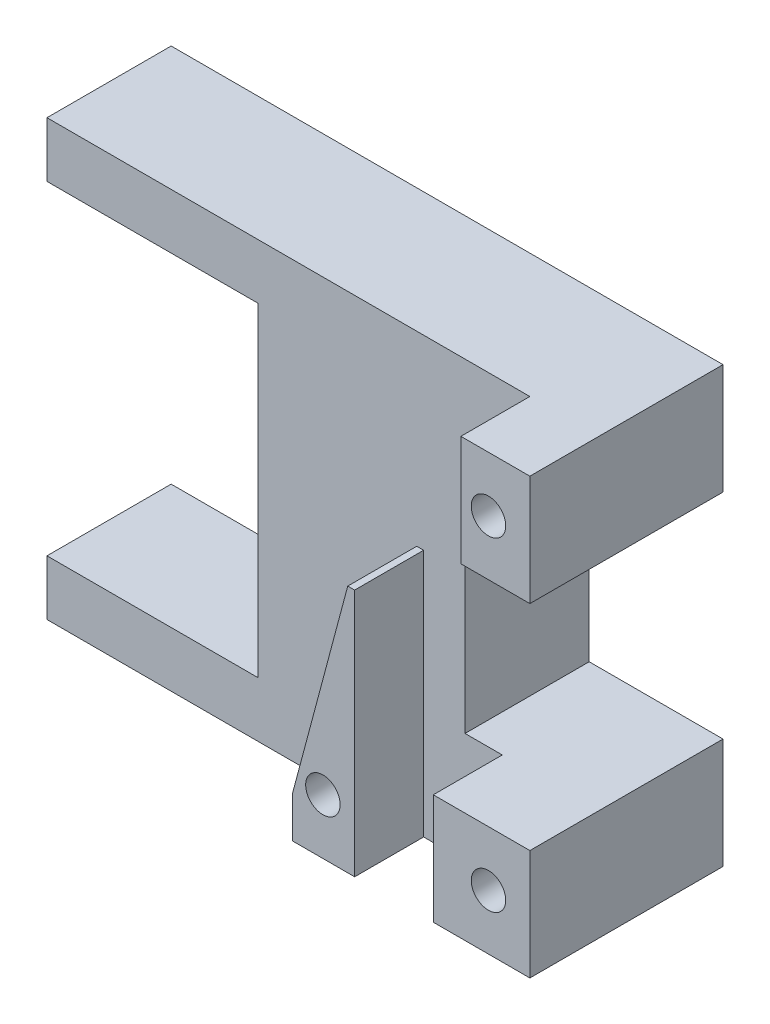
ISO-10303-21;
HEADER;
FILE_DESCRIPTION(('STEP AP214'),'2;1');
FILE_NAME('part.step','',(''),(''),'','','');
FILE_SCHEMA(('AUTOMOTIVE_DESIGN { 1 0 10303 214 1 1 1 1 }'));
ENDSEC;
DATA;
#1=APPLICATION_CONTEXT('core data for automotive mechanical design processes');
#2=APPLICATION_PROTOCOL_DEFINITION('international standard','automotive_design',2000,#1);
#3=PRODUCT_CONTEXT('',#1,'mechanical');
#4=PRODUCT('Part','Part','',(#3));
#5=PRODUCT_RELATED_PRODUCT_CATEGORY('part','',(#4));
#6=PRODUCT_DEFINITION_FORMATION('','',#4);
#7=PRODUCT_DEFINITION_CONTEXT('part definition',#1,'design');
#8=PRODUCT_DEFINITION('design','',#6,#7);
#9=PRODUCT_DEFINITION_SHAPE('','',#8);
#10=(LENGTH_UNIT() NAMED_UNIT(*) SI_UNIT(.MILLI.,.METRE.));
#11=(NAMED_UNIT(*) PLANE_ANGLE_UNIT() SI_UNIT($,.RADIAN.));
#12=(NAMED_UNIT(*) SI_UNIT($,.STERADIAN.) SOLID_ANGLE_UNIT());
#13=UNCERTAINTY_MEASURE_WITH_UNIT(LENGTH_MEASURE(1.E-05),#10,'distance_accuracy_value','');
#14=(GEOMETRIC_REPRESENTATION_CONTEXT(3) GLOBAL_UNCERTAINTY_ASSIGNED_CONTEXT((#13)) GLOBAL_UNIT_ASSIGNED_CONTEXT((#10,
#11,#12)) REPRESENTATION_CONTEXT('',''));
#15=CARTESIAN_POINT('',(0.,0.,0.));
#16=DIRECTION('',(0.,0.,1.));
#17=DIRECTION('',(1.,0.,0.));
#18=AXIS2_PLACEMENT_3D('',#15,#16,#17);
#19=CARTESIAN_POINT('',(0.,0.,9.));
#20=DIRECTION('',(0.,0.,1.));
#21=DIRECTION('',(1.,0.,0.));
#22=AXIS2_PLACEMENT_3D('',#19,#20,#21);
#23=PLANE('',#22);
#24=DIRECTION('',(-1.,0.,0.));
#25=VECTOR('',#24,1.);
#26=CARTESIAN_POINT('',(0.,-3.29328784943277,9.));
#27=LINE('',#26,#25);
#28=CARTESIAN_POINT('',(32.4932731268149,-3.29328784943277,9.));
#29=VERTEX_POINT('',#28);
#30=CARTESIAN_POINT('',(27.7932731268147,-3.29328784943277,9.));
#31=VERTEX_POINT('',#30);
#32=EDGE_CURVE('E225',#29,#31,#27,.T.);
#33=ORIENTED_EDGE('',*,*,#32,.F.);
#34=DIRECTION('',(0.,-1.,0.));
#35=VECTOR('',#34,1.);
#36=CARTESIAN_POINT('',(32.4932731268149,0.,9.));
#37=LINE('',#36,#35);
#38=CARTESIAN_POINT('',(32.4932731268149,4.70671215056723,9.));
#39=VERTEX_POINT('',#38);
#40=EDGE_CURVE('E209',#39,#29,#37,.T.);
#41=ORIENTED_EDGE('',*,*,#40,.F.);
#42=DIRECTION('',(1.,0.,0.));
#43=VECTOR('',#42,1.);
#44=CARTESIAN_POINT('',(0.,4.70671215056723,9.));
#45=LINE('',#44,#43);
#46=CARTESIAN_POINT('',(-2.5067268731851,4.70671215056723,9.));
#47=VERTEX_POINT('',#46);
#48=EDGE_CURVE('E234',#47,#39,#45,.T.);
#49=ORIENTED_EDGE('',*,*,#48,.F.);
#50=DIRECTION('',(0.,-1.,0.));
#51=VECTOR('',#50,1.);
#52=CARTESIAN_POINT('',(-2.5067268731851,0.,9.));
#53=LINE('',#52,#51);
#54=CARTESIAN_POINT('',(-2.5067268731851,0.706712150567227,9.));
#55=VERTEX_POINT('',#54);
#56=EDGE_CURVE('E236',#47,#55,#53,.T.);
#57=ORIENTED_EDGE('',*,*,#56,.T.);
#58=DIRECTION('',(1.,0.,0.));
#59=VECTOR('',#58,1.);
#60=CARTESIAN_POINT('',(0.,0.706712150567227,9.));
#61=LINE('',#60,#59);
#62=CARTESIAN_POINT('',(12.7932731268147,0.706712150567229,9.));
#63=VERTEX_POINT('',#62);
#64=EDGE_CURVE('E243',#55,#63,#61,.T.);
#65=ORIENTED_EDGE('',*,*,#64,.T.);
#66=DIRECTION('',(0.,1.,0.));
#67=VECTOR('',#66,1.);
#68=CARTESIAN_POINT('',(12.7932731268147,0.,9.));
#69=LINE('',#68,#67);
#70=CARTESIAN_POINT('',(12.7932731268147,-22.7932878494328,9.));
#71=VERTEX_POINT('',#70);
#72=EDGE_CURVE('E245',#71,#63,#69,.T.);
#73=ORIENTED_EDGE('',*,*,#72,.F.);
#74=DIRECTION('',(1.,0.,0.));
#75=VECTOR('',#74,1.);
#76=CARTESIAN_POINT('',(0.,-22.7932878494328,9.));
#77=LINE('',#76,#75);
#78=CARTESIAN_POINT('',(-2.5067268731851,-22.7932878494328,9.));
#79=VERTEX_POINT('',#78);
#80=EDGE_CURVE('E248',#79,#71,#77,.T.);
#81=ORIENTED_EDGE('',*,*,#80,.F.);
#82=DIRECTION('',(0.,1.,0.));
#83=VECTOR('',#82,1.);
#84=CARTESIAN_POINT('',(-2.5067268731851,0.,9.));
#85=LINE('',#84,#83);
#86=CARTESIAN_POINT('',(-2.5067268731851,-26.7932878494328,9.));
#87=VERTEX_POINT('',#86);
#88=EDGE_CURVE('E251',#87,#79,#85,.T.);
#89=ORIENTED_EDGE('',*,*,#88,.F.);
#90=DIRECTION('',(1.,0.,0.));
#91=VECTOR('',#90,1.);
#92=CARTESIAN_POINT('',(0.,-26.7932878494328,9.));
#93=LINE('',#92,#91);
#94=CARTESIAN_POINT('',(20.2932731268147,-26.7932878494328,9.));
#95=VERTEX_POINT('',#94);
#96=EDGE_CURVE('E426',#87,#95,#93,.T.);
#97=ORIENTED_EDGE('',*,*,#96,.T.);
#98=DIRECTION('',(0.,1.,0.));
#99=VECTOR('',#98,1.);
#100=CARTESIAN_POINT('',(20.2932731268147,0.,9.));
#101=LINE('',#100,#99);
#102=CARTESIAN_POINT('',(20.2932731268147,-23.793287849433,9.));
#103=VERTEX_POINT('',#102);
#104=EDGE_CURVE('E445',#95,#103,#101,.T.);
#105=ORIENTED_EDGE('',*,*,#104,.T.);
#106=DIRECTION('',(0.257662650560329,0.966234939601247,0.));
#107=VECTOR('',#106,1.);
#108=CARTESIAN_POINT('',(20.2932731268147,-23.793287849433,9.));
#109=LINE('',#108,#107);
#110=CARTESIAN_POINT('',(24.2932731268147,-8.79328784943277,9.));
#111=VERTEX_POINT('',#110);
#112=EDGE_CURVE('E12',#103,#111,#109,.T.);
#113=ORIENTED_EDGE('',*,*,#112,.T.);
#114=DIRECTION('',(-1.,0.,0.));
#115=VECTOR('',#114,1.);
#116=CARTESIAN_POINT('',(0.,-8.79328784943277,9.));
#117=LINE('',#116,#115);
#118=CARTESIAN_POINT('',(24.7932731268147,-8.79328784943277,9.));
#119=VERTEX_POINT('',#118);
#120=EDGE_CURVE('E451',#119,#111,#117,.T.);
#121=ORIENTED_EDGE('',*,*,#120,.F.);
#122=DIRECTION('',(0.,1.,0.));
#123=VECTOR('',#122,1.);
#124=CARTESIAN_POINT('',(24.7932731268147,0.,9.));
#125=LINE('',#124,#123);
#126=CARTESIAN_POINT('',(24.7932731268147,-26.7932878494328,9.));
#127=VERTEX_POINT('',#126);
#128=EDGE_CURVE('E435',#127,#119,#125,.T.);
#129=ORIENTED_EDGE('',*,*,#128,.F.);
#130=CARTESIAN_POINT('',(30.4932731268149,-26.7932878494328,9.));
#131=VERTEX_POINT('',#130);
#132=EDGE_CURVE('E289',#127,#131,#93,.T.);
#133=ORIENTED_EDGE('',*,*,#132,.T.);
#134=DIRECTION('',(0.,1.,0.));
#135=VECTOR('',#134,1.);
#136=CARTESIAN_POINT('',(30.4932731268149,0.,9.));
#137=LINE('',#136,#135);
#138=CARTESIAN_POINT('',(30.4932731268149,-18.7932878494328,9.));
#139=VERTEX_POINT('',#138);
#140=EDGE_CURVE('E432',#131,#139,#137,.T.);
#141=ORIENTED_EDGE('',*,*,#140,.T.);
#142=DIRECTION('',(-1.,0.,0.));
#143=VECTOR('',#142,1.);
#144=CARTESIAN_POINT('',(0.,-18.7932878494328,9.));
#145=LINE('',#144,#143);
#146=CARTESIAN_POINT('',(27.7932731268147,-18.7932878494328,9.));
#147=VERTEX_POINT('',#146);
#148=EDGE_CURVE('E238',#139,#147,#145,.T.);
#149=ORIENTED_EDGE('',*,*,#148,.T.);
#150=DIRECTION('',(0.,1.,0.));
#151=VECTOR('',#150,1.);
#152=CARTESIAN_POINT('',(27.7932731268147,0.,9.));
#153=LINE('',#152,#151);
#154=EDGE_CURVE('E232',#147,#31,#153,.T.);
#155=ORIENTED_EDGE('',*,*,#154,.T.);
#156=EDGE_LOOP('',(#33,#41,#49,#57,#65,#73,#81,#89,#97,#105,#113,#121,#129,#133,#141,#149,#155));
#157=FACE_BOUND('',#156,.T.);
#158=ADVANCED_FACE('F67',(#157),#23,.T.);
#159=CARTESIAN_POINT('',(0.,-26.7932878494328,9.));
#160=DIRECTION('',(0.,1.,0.));
#161=DIRECTION('',(0.,0.,1.));
#162=AXIS2_PLACEMENT_3D('',#159,#160,#161);
#163=PLANE('',#162);
#164=DIRECTION('',(1.,0.,0.));
#165=VECTOR('',#164,1.);
#166=CARTESIAN_POINT('',(0.,-26.7932878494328,0.));
#167=LINE('',#166,#165);
#168=CARTESIAN_POINT('',(-2.5067268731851,-26.7932878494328,0.));
#169=VERTEX_POINT('',#168);
#170=CARTESIAN_POINT('',(37.4932731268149,-26.7932878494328,0.));
#171=VERTEX_POINT('',#170);
#172=EDGE_CURVE('E255',#169,#171,#167,.T.);
#173=ORIENTED_EDGE('',*,*,#172,.T.);
#174=DIRECTION('',(0.,0.,-1.));
#175=VECTOR('',#174,1.);
#176=CARTESIAN_POINT('',(37.4932731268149,-26.7932878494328,9.));
#177=LINE('',#176,#175);
#178=CARTESIAN_POINT('',(37.4932731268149,-26.7932878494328,14.));
#179=VERTEX_POINT('',#178);
#180=EDGE_CURVE('E314',#179,#171,#177,.T.);
#181=ORIENTED_EDGE('',*,*,#180,.F.);
#182=DIRECTION('',(1.,0.,0.));
#183=VECTOR('',#182,1.);
#184=CARTESIAN_POINT('',(0.,-26.7932878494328,14.));
#185=LINE('',#184,#183);
#186=CARTESIAN_POINT('',(30.4932731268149,-26.7932878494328,14.));
#187=VERTEX_POINT('',#186);
#188=EDGE_CURVE('E439',#187,#179,#185,.T.);
#189=ORIENTED_EDGE('',*,*,#188,.F.);
#190=DIRECTION('',(0.,0.,-1.));
#191=VECTOR('',#190,1.);
#192=CARTESIAN_POINT('',(30.4932731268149,-26.7932878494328,14.));
#193=LINE('',#192,#191);
#194=EDGE_CURVE('E259',#187,#131,#193,.T.);
#195=ORIENTED_EDGE('',*,*,#194,.T.);
#196=ORIENTED_EDGE('',*,*,#132,.F.);
#197=DIRECTION('',(0.,0.,-1.));
#198=VECTOR('',#197,1.);
#199=CARTESIAN_POINT('',(24.7932731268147,-26.7932878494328,14.));
#200=LINE('',#199,#198);
#201=CARTESIAN_POINT('',(24.7932731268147,-26.7932878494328,14.));
#202=VERTEX_POINT('',#201);
#203=EDGE_CURVE('E448',#202,#127,#200,.T.);
#204=ORIENTED_EDGE('',*,*,#203,.F.);
#205=DIRECTION('',(1.,0.,0.));
#206=VECTOR('',#205,1.);
#207=CARTESIAN_POINT('',(0.,-26.7932878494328,14.));
#208=LINE('',#207,#206);
#209=CARTESIAN_POINT('',(20.2932731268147,-26.7932878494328,14.));
#210=VERTEX_POINT('',#209);
#211=EDGE_CURVE('E336',#210,#202,#208,.T.);
#212=ORIENTED_EDGE('',*,*,#211,.F.);
#213=DIRECTION('',(0.,0.,-1.));
#214=VECTOR('',#213,1.);
#215=CARTESIAN_POINT('',(20.2932731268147,-26.7932878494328,14.));
#216=LINE('',#215,#214);
#217=EDGE_CURVE('E334',#210,#95,#216,.T.);
#218=ORIENTED_EDGE('',*,*,#217,.T.);
#219=ORIENTED_EDGE('',*,*,#96,.F.);
#220=DIRECTION('',(0.,0.,-1.));
#221=VECTOR('',#220,1.);
#222=CARTESIAN_POINT('',(-2.5067268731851,-26.7932878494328,9.));
#223=LINE('',#222,#221);
#224=EDGE_CURVE('E254',#87,#169,#223,.T.);
#225=ORIENTED_EDGE('',*,*,#224,.T.);
#226=EDGE_LOOP('',(#173,#181,#189,#195,#196,#204,#212,#218,#219,#225));
#227=FACE_BOUND('',#226,.T.);
#228=ADVANCED_FACE('F353',(#227),#163,.F.);
#229=CARTESIAN_POINT('',(37.4932731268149,0.,9.));
#230=DIRECTION('',(-1.,0.,0.));
#231=DIRECTION('',(0.,0.,1.));
#232=AXIS2_PLACEMENT_3D('',#229,#230,#231);
#233=PLANE('',#232);
#234=DIRECTION('',(0.,1.,0.));
#235=VECTOR('',#234,1.);
#236=CARTESIAN_POINT('',(37.4932731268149,0.,0.));
#237=LINE('',#236,#235);
#238=CARTESIAN_POINT('',(37.4932731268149,-18.7932878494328,0.));
#239=VERTEX_POINT('',#238);
#240=EDGE_CURVE('E258',#171,#239,#237,.T.);
#241=ORIENTED_EDGE('',*,*,#240,.T.);
#242=DIRECTION('',(0.,0.,-1.));
#243=VECTOR('',#242,1.);
#244=CARTESIAN_POINT('',(37.4932731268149,-18.7932878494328,9.));
#245=LINE('',#244,#243);
#246=CARTESIAN_POINT('',(37.4932731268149,-18.7932878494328,14.));
#247=VERTEX_POINT('',#246);
#248=EDGE_CURVE('E311',#247,#239,#245,.T.);
#249=ORIENTED_EDGE('',*,*,#248,.F.);
#250=DIRECTION('',(0.,1.,0.));
#251=VECTOR('',#250,1.);
#252=CARTESIAN_POINT('',(37.4932731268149,0.,14.));
#253=LINE('',#252,#251);
#254=EDGE_CURVE('E437',#179,#247,#253,.T.);
#255=ORIENTED_EDGE('',*,*,#254,.F.);
#256=ORIENTED_EDGE('',*,*,#180,.T.);
#257=EDGE_LOOP('',(#241,#249,#255,#256));
#258=FACE_BOUND('',#257,.T.);
#259=ADVANCED_FACE('F360',(#258),#233,.F.);
#260=CARTESIAN_POINT('',(0.,-18.7932878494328,9.));
#261=DIRECTION('',(0.,-1.,0.));
#262=DIRECTION('',(0.,0.,-1.));
#263=AXIS2_PLACEMENT_3D('',#260,#261,#262);
#264=PLANE('',#263);
#265=DIRECTION('',(-1.,0.,0.));
#266=VECTOR('',#265,1.);
#267=CARTESIAN_POINT('',(0.,-18.7932878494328,0.));
#268=LINE('',#267,#266);
#269=CARTESIAN_POINT('',(27.7932731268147,-18.7932878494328,0.));
#270=VERTEX_POINT('',#269);
#271=EDGE_CURVE('E261',#239,#270,#268,.T.);
#272=ORIENTED_EDGE('',*,*,#271,.T.);
#273=DIRECTION('',(0.,0.,-1.));
#274=VECTOR('',#273,1.);
#275=CARTESIAN_POINT('',(27.7932731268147,-18.7932878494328,9.));
#276=LINE('',#275,#274);
#277=EDGE_CURVE('E308',#147,#270,#276,.T.);
#278=ORIENTED_EDGE('',*,*,#277,.F.);
#279=ORIENTED_EDGE('',*,*,#148,.F.);
#280=DIRECTION('',(0.,0.,-1.));
#281=VECTOR('',#280,1.);
#282=CARTESIAN_POINT('',(30.4932731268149,-18.7932878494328,14.));
#283=LINE('',#282,#281);
#284=CARTESIAN_POINT('',(30.4932731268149,-18.7932878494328,14.));
#285=VERTEX_POINT('',#284);
#286=EDGE_CURVE('E423',#285,#139,#283,.T.);
#287=ORIENTED_EDGE('',*,*,#286,.F.);
#288=DIRECTION('',(-1.,0.,0.));
#289=VECTOR('',#288,1.);
#290=CARTESIAN_POINT('',(0.,-18.7932878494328,14.));
#291=LINE('',#290,#289);
#292=EDGE_CURVE('E420',#247,#285,#291,.T.);
#293=ORIENTED_EDGE('',*,*,#292,.F.);
#294=ORIENTED_EDGE('',*,*,#248,.T.);
#295=EDGE_LOOP('',(#272,#278,#279,#287,#293,#294));
#296=FACE_BOUND('',#295,.T.);
#297=ADVANCED_FACE('F403',(#296),#264,.F.);
#298=CARTESIAN_POINT('',(27.7932731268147,0.,9.));
#299=DIRECTION('',(-1.,0.,0.));
#300=DIRECTION('',(0.,-1.,0.));
#301=AXIS2_PLACEMENT_3D('',#298,#299,#300);
#302=PLANE('',#301);
#303=DIRECTION('',(0.,1.,0.));
#304=VECTOR('',#303,1.);
#305=CARTESIAN_POINT('',(27.7932731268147,0.,0.));
#306=LINE('',#305,#304);
#307=CARTESIAN_POINT('',(27.7932731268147,-3.29328784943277,0.));
#308=VERTEX_POINT('',#307);
#309=EDGE_CURVE('E263',#270,#308,#306,.T.);
#310=ORIENTED_EDGE('',*,*,#309,.T.);
#311=DIRECTION('',(0.,0.,-1.));
#312=VECTOR('',#311,1.);
#313=CARTESIAN_POINT('',(27.7932731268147,-3.29328784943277,9.));
#314=LINE('',#313,#312);
#315=EDGE_CURVE('E306',#31,#308,#314,.T.);
#316=ORIENTED_EDGE('',*,*,#315,.F.);
#317=ORIENTED_EDGE('',*,*,#154,.F.);
#318=ORIENTED_EDGE('',*,*,#277,.T.);
#319=EDGE_LOOP('',(#310,#316,#317,#318));
#320=FACE_BOUND('',#319,.T.);
#321=ADVANCED_FACE('F400',(#320),#302,.F.);
#322=CARTESIAN_POINT('',(0.,-3.29328784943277,9.));
#323=DIRECTION('',(0.,-1.,0.));
#324=DIRECTION('',(0.,0.,-1.));
#325=AXIS2_PLACEMENT_3D('',#322,#323,#324);
#326=PLANE('',#325);
#327=DIRECTION('',(-1.,0.,0.));
#328=VECTOR('',#327,1.);
#329=CARTESIAN_POINT('',(0.,-3.29328784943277,0.));
#330=LINE('',#329,#328);
#331=CARTESIAN_POINT('',(37.4932731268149,-3.29328784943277,0.));
#332=VERTEX_POINT('',#331);
#333=EDGE_CURVE('E266',#332,#308,#330,.T.);
#334=ORIENTED_EDGE('',*,*,#333,.F.);
#335=DIRECTION('',(0.,0.,-1.));
#336=VECTOR('',#335,1.);
#337=CARTESIAN_POINT('',(37.4932731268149,-3.29328784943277,9.));
#338=LINE('',#337,#336);
#339=CARTESIAN_POINT('',(37.4932731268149,-3.29328784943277,14.));
#340=VERTEX_POINT('',#339);
#341=EDGE_CURVE('E304',#340,#332,#338,.T.);
#342=ORIENTED_EDGE('',*,*,#341,.F.);
#343=DIRECTION('',(1.,0.,0.));
#344=VECTOR('',#343,1.);
#345=CARTESIAN_POINT('',(0.,-3.29328784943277,14.));
#346=LINE('',#345,#344);
#347=CARTESIAN_POINT('',(32.4932731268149,-3.29328784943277,14.));
#348=VERTEX_POINT('',#347);
#349=EDGE_CURVE('E228',#348,#340,#346,.T.);
#350=ORIENTED_EDGE('',*,*,#349,.F.);
#351=DIRECTION('',(0.,0.,-1.));
#352=VECTOR('',#351,1.);
#353=CARTESIAN_POINT('',(32.4932731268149,-3.29328784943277,14.));
#354=LINE('',#353,#352);
#355=EDGE_CURVE('E212',#348,#29,#354,.T.);
#356=ORIENTED_EDGE('',*,*,#355,.T.);
#357=ORIENTED_EDGE('',*,*,#32,.T.);
#358=ORIENTED_EDGE('',*,*,#315,.T.);
#359=EDGE_LOOP('',(#334,#342,#350,#356,#357,#358));
#360=FACE_BOUND('',#359,.T.);
#361=ADVANCED_FACE('F224',(#360),#326,.T.);
#362=CARTESIAN_POINT('',(37.4932731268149,0.,9.));
#363=DIRECTION('',(1.,0.,0.));
#364=DIRECTION('',(0.,0.,-1.));
#365=AXIS2_PLACEMENT_3D('',#362,#363,#364);
#366=PLANE('',#365);
#367=DIRECTION('',(0.,-1.,0.));
#368=VECTOR('',#367,1.);
#369=CARTESIAN_POINT('',(37.4932731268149,0.,0.));
#370=LINE('',#369,#368);
#371=CARTESIAN_POINT('',(37.4932731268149,4.70671215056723,0.));
#372=VERTEX_POINT('',#371);
#373=EDGE_CURVE('E269',#372,#332,#370,.T.);
#374=ORIENTED_EDGE('',*,*,#373,.F.);
#375=DIRECTION('',(0.,0.,-1.));
#376=VECTOR('',#375,1.);
#377=CARTESIAN_POINT('',(37.4932731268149,4.70671215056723,9.));
#378=LINE('',#377,#376);
#379=CARTESIAN_POINT('',(37.4932731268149,4.70671215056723,14.));
#380=VERTEX_POINT('',#379);
#381=EDGE_CURVE('E302',#380,#372,#378,.T.);
#382=ORIENTED_EDGE('',*,*,#381,.F.);
#383=DIRECTION('',(0.,1.,0.));
#384=VECTOR('',#383,1.);
#385=CARTESIAN_POINT('',(37.4932731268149,0.,14.));
#386=LINE('',#385,#384);
#387=EDGE_CURVE('E229',#340,#380,#386,.T.);
#388=ORIENTED_EDGE('',*,*,#387,.F.);
#389=ORIENTED_EDGE('',*,*,#341,.T.);
#390=EDGE_LOOP('',(#374,#382,#388,#389));
#391=FACE_BOUND('',#390,.T.);
#392=ADVANCED_FACE('F393',(#391),#366,.T.);
#393=CARTESIAN_POINT('',(0.,4.70671215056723,9.));
#394=DIRECTION('',(0.,1.,0.));
#395=DIRECTION('',(-1.,0.,0.));
#396=AXIS2_PLACEMENT_3D('',#393,#394,#395);
#397=PLANE('',#396);
#398=DIRECTION('',(1.,0.,0.));
#399=VECTOR('',#398,1.);
#400=CARTESIAN_POINT('',(0.,4.70671215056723,0.));
#401=LINE('',#400,#399);
#402=CARTESIAN_POINT('',(-2.5067268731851,4.70671215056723,0.));
#403=VERTEX_POINT('',#402);
#404=EDGE_CURVE('E272',#403,#372,#401,.T.);
#405=ORIENTED_EDGE('',*,*,#404,.F.);
#406=DIRECTION('',(0.,0.,-1.));
#407=VECTOR('',#406,1.);
#408=CARTESIAN_POINT('',(-2.5067268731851,4.70671215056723,9.));
#409=LINE('',#408,#407);
#410=EDGE_CURVE('E300',#47,#403,#409,.T.);
#411=ORIENTED_EDGE('',*,*,#410,.F.);
#412=ORIENTED_EDGE('',*,*,#48,.T.);
#413=DIRECTION('',(0.,0.,-1.));
#414=VECTOR('',#413,1.);
#415=CARTESIAN_POINT('',(32.4932731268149,4.70671215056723,14.));
#416=LINE('',#415,#414);
#417=CARTESIAN_POINT('',(32.4932731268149,4.70671215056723,14.));
#418=VERTEX_POINT('',#417);
#419=EDGE_CURVE('E215',#418,#39,#416,.T.);
#420=ORIENTED_EDGE('',*,*,#419,.F.);
#421=DIRECTION('',(-1.,0.,0.));
#422=VECTOR('',#421,1.);
#423=CARTESIAN_POINT('',(0.,4.70671215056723,14.));
#424=LINE('',#423,#422);
#425=EDGE_CURVE('E220',#380,#418,#424,.T.);
#426=ORIENTED_EDGE('',*,*,#425,.F.);
#427=ORIENTED_EDGE('',*,*,#381,.T.);
#428=EDGE_LOOP('',(#405,#411,#412,#420,#426,#427));
#429=FACE_BOUND('',#428,.T.);
#430=ADVANCED_FACE('F389',(#429),#397,.T.);
#431=CARTESIAN_POINT('',(-2.5067268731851,0.,9.));
#432=DIRECTION('',(1.,0.,0.));
#433=DIRECTION('',(0.,0.,-1.));
#434=AXIS2_PLACEMENT_3D('',#431,#432,#433);
#435=PLANE('',#434);
#436=DIRECTION('',(0.,-1.,0.));
#437=VECTOR('',#436,1.);
#438=CARTESIAN_POINT('',(-2.5067268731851,0.,0.));
#439=LINE('',#438,#437);
#440=CARTESIAN_POINT('',(-2.5067268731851,0.706712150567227,0.));
#441=VERTEX_POINT('',#440);
#442=EDGE_CURVE('E275',#403,#441,#439,.T.);
#443=ORIENTED_EDGE('',*,*,#442,.T.);
#444=DIRECTION('',(0.,0.,-1.));
#445=VECTOR('',#444,1.);
#446=CARTESIAN_POINT('',(-2.5067268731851,0.706712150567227,9.));
#447=LINE('',#446,#445);
#448=EDGE_CURVE('E297',#55,#441,#447,.T.);
#449=ORIENTED_EDGE('',*,*,#448,.F.);
#450=ORIENTED_EDGE('',*,*,#56,.F.);
#451=ORIENTED_EDGE('',*,*,#410,.T.);
#452=EDGE_LOOP('',(#443,#449,#450,#451));
#453=FACE_BOUND('',#452,.T.);
#454=ADVANCED_FACE('F385',(#453),#435,.F.);
#455=CARTESIAN_POINT('',(0.,0.706712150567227,9.));
#456=DIRECTION('',(0.,1.,0.));
#457=DIRECTION('',(-1.,0.,0.));
#458=AXIS2_PLACEMENT_3D('',#455,#456,#457);
#459=PLANE('',#458);
#460=DIRECTION('',(1.,0.,0.));
#461=VECTOR('',#460,1.);
#462=CARTESIAN_POINT('',(0.,0.706712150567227,0.));
#463=LINE('',#462,#461);
#464=CARTESIAN_POINT('',(12.7932731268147,0.706712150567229,0.));
#465=VERTEX_POINT('',#464);
#466=EDGE_CURVE('E277',#441,#465,#463,.T.);
#467=ORIENTED_EDGE('',*,*,#466,.T.);
#468=DIRECTION('',(0.,0.,-1.));
#469=VECTOR('',#468,1.);
#470=CARTESIAN_POINT('',(12.7932731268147,0.706712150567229,9.));
#471=LINE('',#470,#469);
#472=EDGE_CURVE('E295',#63,#465,#471,.T.);
#473=ORIENTED_EDGE('',*,*,#472,.F.);
#474=ORIENTED_EDGE('',*,*,#64,.F.);
#475=ORIENTED_EDGE('',*,*,#448,.T.);
#476=EDGE_LOOP('',(#467,#473,#474,#475));
#477=FACE_BOUND('',#476,.T.);
#478=ADVANCED_FACE('F381',(#477),#459,.F.);
#479=CARTESIAN_POINT('',(12.7932731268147,0.,9.));
#480=DIRECTION('',(-1.,0.,0.));
#481=DIRECTION('',(0.,-1.,0.));
#482=AXIS2_PLACEMENT_3D('',#479,#480,#481);
#483=PLANE('',#482);
#484=DIRECTION('',(0.,1.,0.));
#485=VECTOR('',#484,1.);
#486=CARTESIAN_POINT('',(12.7932731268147,0.,0.));
#487=LINE('',#486,#485);
#488=CARTESIAN_POINT('',(12.7932731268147,-22.7932878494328,0.));
#489=VERTEX_POINT('',#488);
#490=EDGE_CURVE('E280',#489,#465,#487,.T.);
#491=ORIENTED_EDGE('',*,*,#490,.F.);
#492=DIRECTION('',(0.,0.,-1.));
#493=VECTOR('',#492,1.);
#494=CARTESIAN_POINT('',(12.7932731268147,-22.7932878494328,9.));
#495=LINE('',#494,#493);
#496=EDGE_CURVE('E293',#71,#489,#495,.T.);
#497=ORIENTED_EDGE('',*,*,#496,.F.);
#498=ORIENTED_EDGE('',*,*,#72,.T.);
#499=ORIENTED_EDGE('',*,*,#472,.T.);
#500=EDGE_LOOP('',(#491,#497,#498,#499));
#501=FACE_BOUND('',#500,.T.);
#502=ADVANCED_FACE('F377',(#501),#483,.T.);
#503=CARTESIAN_POINT('',(0.,-22.7932878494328,9.));
#504=DIRECTION('',(0.,1.,0.));
#505=DIRECTION('',(0.,0.,1.));
#506=AXIS2_PLACEMENT_3D('',#503,#504,#505);
#507=PLANE('',#506);
#508=DIRECTION('',(1.,0.,0.));
#509=VECTOR('',#508,1.);
#510=CARTESIAN_POINT('',(0.,-22.7932878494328,0.));
#511=LINE('',#510,#509);
#512=CARTESIAN_POINT('',(-2.5067268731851,-22.7932878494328,0.));
#513=VERTEX_POINT('',#512);
#514=EDGE_CURVE('E283',#513,#489,#511,.T.);
#515=ORIENTED_EDGE('',*,*,#514,.F.);
#516=DIRECTION('',(0.,0.,-1.));
#517=VECTOR('',#516,1.);
#518=CARTESIAN_POINT('',(-2.5067268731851,-22.7932878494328,9.));
#519=LINE('',#518,#517);
#520=EDGE_CURVE('E291',#79,#513,#519,.T.);
#521=ORIENTED_EDGE('',*,*,#520,.F.);
#522=ORIENTED_EDGE('',*,*,#80,.T.);
#523=ORIENTED_EDGE('',*,*,#496,.T.);
#524=EDGE_LOOP('',(#515,#521,#522,#523));
#525=FACE_BOUND('',#524,.T.);
#526=ADVANCED_FACE('F373',(#525),#507,.T.);
#527=CARTESIAN_POINT('',(-2.5067268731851,0.,9.));
#528=DIRECTION('',(-1.,0.,0.));
#529=DIRECTION('',(0.,0.,1.));
#530=AXIS2_PLACEMENT_3D('',#527,#528,#529);
#531=PLANE('',#530);
#532=DIRECTION('',(0.,1.,0.));
#533=VECTOR('',#532,1.);
#534=CARTESIAN_POINT('',(-2.5067268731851,0.,0.));
#535=LINE('',#534,#533);
#536=EDGE_CURVE('E286',#169,#513,#535,.T.);
#537=ORIENTED_EDGE('',*,*,#536,.F.);
#538=ORIENTED_EDGE('',*,*,#224,.F.);
#539=ORIENTED_EDGE('',*,*,#88,.T.);
#540=ORIENTED_EDGE('',*,*,#520,.T.);
#541=EDGE_LOOP('',(#537,#538,#539,#540));
#542=FACE_BOUND('',#541,.T.);
#543=ADVANCED_FACE('F369',(#542),#531,.T.);
#544=CARTESIAN_POINT('',(0.,0.,0.));
#545=DIRECTION('',(0.,0.,1.));
#546=DIRECTION('',(1.,0.,0.));
#547=AXIS2_PLACEMENT_3D('',#544,#545,#546);
#548=PLANE('',#547);
#549=CARTESIAN_POINT('',(25.2932731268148,-21.7932878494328,0.));
#550=DIRECTION('',(0.,0.,-1.));
#551=DIRECTION('',(-1.,0.,0.));
#552=AXIS2_PLACEMENT_3D('',#549,#550,#551);
#553=CIRCLE('',#552,1.25);
#554=CARTESIAN_POINT('',(24.0432731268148,-21.7932878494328,0.));
#555=VERTEX_POINT('',#554);
#556=EDGE_CURVE('E492',#555,#555,#553,.T.);
#557=ORIENTED_EDGE('',*,*,#556,.F.);
#558=EDGE_LOOP('',(#557));
#559=FACE_BOUND('',#558,.T.);
#560=CARTESIAN_POINT('',(15.2932731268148,-21.7932878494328,0.));
#561=DIRECTION('',(0.,0.,-1.));
#562=DIRECTION('',(-1.,0.,0.));
#563=AXIS2_PLACEMENT_3D('',#560,#561,#562);
#564=CIRCLE('',#563,1.25);
#565=CARTESIAN_POINT('',(14.0432731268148,-21.7932878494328,0.));
#566=VERTEX_POINT('',#565);
#567=EDGE_CURVE('E498',#566,#566,#564,.T.);
#568=ORIENTED_EDGE('',*,*,#567,.F.);
#569=EDGE_LOOP('',(#568));
#570=FACE_BOUND('',#569,.T.);
#571=CARTESIAN_POINT('',(15.2932731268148,-1.79328784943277,0.));
#572=DIRECTION('',(0.,0.,-1.));
#573=DIRECTION('',(-1.,0.,0.));
#574=AXIS2_PLACEMENT_3D('',#571,#572,#573);
#575=CIRCLE('',#574,1.25);
#576=CARTESIAN_POINT('',(14.0432731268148,-1.79328784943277,0.));
#577=VERTEX_POINT('',#576);
#578=EDGE_CURVE('E504',#577,#577,#575,.T.);
#579=ORIENTED_EDGE('',*,*,#578,.F.);
#580=EDGE_LOOP('',(#579));
#581=FACE_BOUND('',#580,.T.);
#582=CARTESIAN_POINT('',(25.2932731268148,-1.79328784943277,0.));
#583=DIRECTION('',(0.,0.,-1.));
#584=DIRECTION('',(-1.,0.,0.));
#585=AXIS2_PLACEMENT_3D('',#582,#583,#584);
#586=CIRCLE('',#585,1.25);
#587=CARTESIAN_POINT('',(24.0432731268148,-1.79328784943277,0.));
#588=VERTEX_POINT('',#587);
#589=EDGE_CURVE('E486',#588,#588,#586,.T.);
#590=ORIENTED_EDGE('',*,*,#589,.F.);
#591=EDGE_LOOP('',(#590));
#592=FACE_BOUND('',#591,.T.);
#593=ORIENTED_EDGE('',*,*,#172,.F.);
#594=ORIENTED_EDGE('',*,*,#536,.T.);
#595=ORIENTED_EDGE('',*,*,#514,.T.);
#596=ORIENTED_EDGE('',*,*,#490,.T.);
#597=ORIENTED_EDGE('',*,*,#466,.F.);
#598=ORIENTED_EDGE('',*,*,#442,.F.);
#599=ORIENTED_EDGE('',*,*,#404,.T.);
#600=ORIENTED_EDGE('',*,*,#373,.T.);
#601=ORIENTED_EDGE('',*,*,#333,.T.);
#602=ORIENTED_EDGE('',*,*,#309,.F.);
#603=ORIENTED_EDGE('',*,*,#271,.F.);
#604=ORIENTED_EDGE('',*,*,#240,.F.);
#605=EDGE_LOOP('',(#593,#594,#595,#596,#597,#598,#599,#600,#601,#602,#603,#604));
#606=FACE_BOUND('',#605,.T.);
#607=ADVANCED_FACE('F366',(#559,#570,#581,#592,#606),#548,.F.);
#608=CARTESIAN_POINT('',(30.4932731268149,0.,14.));
#609=DIRECTION('',(-1.,0.,0.));
#610=DIRECTION('',(0.,0.,1.));
#611=AXIS2_PLACEMENT_3D('',#608,#609,#610);
#612=PLANE('',#611);
#613=ORIENTED_EDGE('',*,*,#140,.F.);
#614=ORIENTED_EDGE('',*,*,#194,.F.);
#615=DIRECTION('',(0.,1.,0.));
#616=VECTOR('',#615,1.);
#617=CARTESIAN_POINT('',(30.4932731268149,0.,14.));
#618=LINE('',#617,#616);
#619=EDGE_CURVE('E434',#187,#285,#618,.T.);
#620=ORIENTED_EDGE('',*,*,#619,.T.);
#621=ORIENTED_EDGE('',*,*,#286,.T.);
#622=EDGE_LOOP('',(#613,#614,#620,#621));
#623=FACE_BOUND('',#622,.T.);
#624=ADVANCED_FACE('F364',(#623),#612,.T.);
#625=CARTESIAN_POINT('',(0.,0.,14.));
#626=DIRECTION('',(0.,0.,1.));
#627=DIRECTION('',(1.,0.,0.));
#628=AXIS2_PLACEMENT_3D('',#625,#626,#627);
#629=PLANE('',#628);
#630=CARTESIAN_POINT('',(34.4932731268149,-22.7932878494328,14.));
#631=DIRECTION('',(0.,0.,1.));
#632=DIRECTION('',(1.,0.,0.));
#633=AXIS2_PLACEMENT_3D('',#630,#631,#632);
#634=CIRCLE('',#633,1.25);
#635=CARTESIAN_POINT('',(35.7432731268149,-22.7932878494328,14.));
#636=VERTEX_POINT('',#635);
#637=EDGE_CURVE('E468',#636,#636,#634,.T.);
#638=ORIENTED_EDGE('',*,*,#637,.F.);
#639=EDGE_LOOP('',(#638));
#640=FACE_BOUND('',#639,.T.);
#641=ORIENTED_EDGE('',*,*,#619,.F.);
#642=ORIENTED_EDGE('',*,*,#188,.T.);
#643=ORIENTED_EDGE('',*,*,#254,.T.);
#644=ORIENTED_EDGE('',*,*,#292,.T.);
#645=EDGE_LOOP('',(#641,#642,#643,#644));
#646=FACE_BOUND('',#645,.T.);
#647=ADVANCED_FACE('F560',(#640,#646),#629,.T.);
#648=CARTESIAN_POINT('',(0.,-8.79328784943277,14.));
#649=DIRECTION('',(0.,-1.,0.));
#650=DIRECTION('',(0.,0.,-1.));
#651=AXIS2_PLACEMENT_3D('',#648,#649,#650);
#652=PLANE('',#651);
#653=ORIENTED_EDGE('',*,*,#120,.T.);
#654=DIRECTION('',(0.,0.,1.));
#655=VECTOR('',#654,1.);
#656=CARTESIAN_POINT('',(24.2932731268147,-8.79328784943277,14.));
#657=LINE('',#656,#655);
#658=CARTESIAN_POINT('',(24.2932731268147,-8.79328784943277,14.));
#659=VERTEX_POINT('',#658);
#660=EDGE_CURVE('E83',#111,#659,#657,.T.);
#661=ORIENTED_EDGE('',*,*,#660,.T.);
#662=DIRECTION('',(-1.,0.,0.));
#663=VECTOR('',#662,1.);
#664=CARTESIAN_POINT('',(0.,-8.79328784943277,14.));
#665=LINE('',#664,#663);
#666=CARTESIAN_POINT('',(24.7932731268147,-8.79328784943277,14.));
#667=VERTEX_POINT('',#666);
#668=EDGE_CURVE('E327',#667,#659,#665,.T.);
#669=ORIENTED_EDGE('',*,*,#668,.F.);
#670=DIRECTION('',(0.,0.,-1.));
#671=VECTOR('',#670,1.);
#672=CARTESIAN_POINT('',(24.7932731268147,-8.79328784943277,14.));
#673=LINE('',#672,#671);
#674=EDGE_CURVE('E219',#667,#119,#673,.T.);
#675=ORIENTED_EDGE('',*,*,#674,.T.);
#676=EDGE_LOOP('',(#653,#661,#669,#675));
#677=FACE_BOUND('',#676,.T.);
#678=ADVANCED_FACE('F558',(#677),#652,.F.);
#679=CARTESIAN_POINT('',(20.2932731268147,0.,14.));
#680=DIRECTION('',(-1.,0.,0.));
#681=DIRECTION('',(0.,0.,1.));
#682=AXIS2_PLACEMENT_3D('',#679,#680,#681);
#683=PLANE('',#682);
#684=DIRECTION('',(0.,1.,0.));
#685=VECTOR('',#684,1.);
#686=CARTESIAN_POINT('',(20.2932731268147,0.,14.));
#687=LINE('',#686,#685);
#688=CARTESIAN_POINT('',(20.2932731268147,-23.793287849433,14.));
#689=VERTEX_POINT('',#688);
#690=EDGE_CURVE('E325',#210,#689,#687,.T.);
#691=ORIENTED_EDGE('',*,*,#690,.T.);
#692=DIRECTION('',(0.,0.,-1.));
#693=VECTOR('',#692,1.);
#694=CARTESIAN_POINT('',(20.2932731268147,-23.793287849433,9.));
#695=LINE('',#694,#693);
#696=EDGE_CURVE('E317',#689,#103,#695,.T.);
#697=ORIENTED_EDGE('',*,*,#696,.T.);
#698=ORIENTED_EDGE('',*,*,#104,.F.);
#699=ORIENTED_EDGE('',*,*,#217,.F.);
#700=EDGE_LOOP('',(#691,#697,#698,#699));
#701=FACE_BOUND('',#700,.T.);
#702=ADVANCED_FACE('F331',(#701),#683,.T.);
#703=CARTESIAN_POINT('',(24.7932731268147,0.,14.));
#704=DIRECTION('',(-1.,0.,0.));
#705=DIRECTION('',(0.,0.,1.));
#706=AXIS2_PLACEMENT_3D('',#703,#704,#705);
#707=PLANE('',#706);
#708=ORIENTED_EDGE('',*,*,#128,.T.);
#709=ORIENTED_EDGE('',*,*,#674,.F.);
#710=DIRECTION('',(0.,1.,0.));
#711=VECTOR('',#710,1.);
#712=CARTESIAN_POINT('',(24.7932731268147,0.,14.));
#713=LINE('',#712,#711);
#714=EDGE_CURVE('E443',#202,#667,#713,.T.);
#715=ORIENTED_EDGE('',*,*,#714,.F.);
#716=ORIENTED_EDGE('',*,*,#203,.T.);
#717=EDGE_LOOP('',(#708,#709,#715,#716));
#718=FACE_BOUND('',#717,.T.);
#719=ADVANCED_FACE('F554',(#718),#707,.F.);
#720=CARTESIAN_POINT('',(0.,0.,14.));
#721=DIRECTION('',(0.,0.,1.));
#722=DIRECTION('',(1.,0.,0.));
#723=AXIS2_PLACEMENT_3D('',#720,#721,#722);
#724=PLANE('',#723);
#725=CARTESIAN_POINT('',(22.4932731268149,-22.7932878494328,14.));
#726=DIRECTION('',(0.,0.,1.));
#727=DIRECTION('',(1.,0.,0.));
#728=AXIS2_PLACEMENT_3D('',#725,#726,#727);
#729=CIRCLE('',#728,1.25);
#730=CARTESIAN_POINT('',(23.7432731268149,-22.7932878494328,14.));
#731=VERTEX_POINT('',#730);
#732=EDGE_CURVE('E477',#731,#731,#729,.T.);
#733=ORIENTED_EDGE('',*,*,#732,.F.);
#734=EDGE_LOOP('',(#733));
#735=FACE_BOUND('',#734,.T.);
#736=ORIENTED_EDGE('',*,*,#668,.T.);
#737=DIRECTION('',(-0.257662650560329,-0.966234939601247,0.));
#738=VECTOR('',#737,1.);
#739=CARTESIAN_POINT('',(24.8696420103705,-6.63190453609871,14.));
#740=LINE('',#739,#738);
#741=EDGE_CURVE('E76',#659,#689,#740,.T.);
#742=ORIENTED_EDGE('',*,*,#741,.T.);
#743=ORIENTED_EDGE('',*,*,#690,.F.);
#744=ORIENTED_EDGE('',*,*,#211,.T.);
#745=ORIENTED_EDGE('',*,*,#714,.T.);
#746=EDGE_LOOP('',(#736,#742,#743,#744,#745));
#747=FACE_BOUND('',#746,.T.);
#748=ADVANCED_FACE('F324',(#735,#747),#724,.T.);
#749=CARTESIAN_POINT('',(32.4932731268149,0.,14.));
#750=DIRECTION('',(1.,0.,0.));
#751=DIRECTION('',(0.,0.,-1.));
#752=AXIS2_PLACEMENT_3D('',#749,#750,#751);
#753=PLANE('',#752);
#754=ORIENTED_EDGE('',*,*,#40,.T.);
#755=ORIENTED_EDGE('',*,*,#355,.F.);
#756=DIRECTION('',(0.,-1.,0.));
#757=VECTOR('',#756,1.);
#758=CARTESIAN_POINT('',(32.4932731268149,0.,14.));
#759=LINE('',#758,#757);
#760=EDGE_CURVE('E461',#418,#348,#759,.T.);
#761=ORIENTED_EDGE('',*,*,#760,.F.);
#762=ORIENTED_EDGE('',*,*,#419,.T.);
#763=EDGE_LOOP('',(#754,#755,#761,#762));
#764=FACE_BOUND('',#763,.T.);
#765=ADVANCED_FACE('F211',(#764),#753,.F.);
#766=CARTESIAN_POINT('',(0.,0.,14.));
#767=DIRECTION('',(0.,0.,1.));
#768=DIRECTION('',(1.,0.,0.));
#769=AXIS2_PLACEMENT_3D('',#766,#767,#768);
#770=PLANE('',#769);
#771=CARTESIAN_POINT('',(34.4932731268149,0.706712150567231,14.));
#772=DIRECTION('',(0.,0.,1.));
#773=DIRECTION('',(1.,0.,0.));
#774=AXIS2_PLACEMENT_3D('',#771,#772,#773);
#775=CIRCLE('',#774,1.25);
#776=CARTESIAN_POINT('',(35.7432731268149,0.706712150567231,14.));
#777=VERTEX_POINT('',#776);
#778=EDGE_CURVE('E471',#777,#777,#775,.T.);
#779=ORIENTED_EDGE('',*,*,#778,.F.);
#780=EDGE_LOOP('',(#779));
#781=FACE_BOUND('',#780,.T.);
#782=ORIENTED_EDGE('',*,*,#425,.T.);
#783=ORIENTED_EDGE('',*,*,#760,.T.);
#784=ORIENTED_EDGE('',*,*,#349,.T.);
#785=ORIENTED_EDGE('',*,*,#387,.T.);
#786=EDGE_LOOP('',(#782,#783,#784,#785));
#787=FACE_BOUND('',#786,.T.);
#788=ADVANCED_FACE('F340',(#781,#787),#770,.T.);
#789=CARTESIAN_POINT('',(20.2932731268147,-23.793287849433,14.));
#790=DIRECTION('',(-0.966234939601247,0.257662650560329,0.));
#791=DIRECTION('',(0.,0.,1.));
#792=AXIS2_PLACEMENT_3D('',#789,#790,#791);
#793=PLANE('',#792);
#794=ORIENTED_EDGE('',*,*,#741,.F.);
#795=ORIENTED_EDGE('',*,*,#660,.F.);
#796=ORIENTED_EDGE('',*,*,#112,.F.);
#797=ORIENTED_EDGE('',*,*,#696,.F.);
#798=EDGE_LOOP('',(#794,#795,#796,#797));
#799=FACE_BOUND('',#798,.T.);
#800=ADVANCED_FACE('F70',(#799),#793,.T.);
#801=CARTESIAN_POINT('',(34.4932731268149,0.706712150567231,9.));
#802=DIRECTION('',(0.,0.,1.));
#803=DIRECTION('',(1.,0.,0.));
#804=AXIS2_PLACEMENT_3D('',#801,#802,#803);
#805=CYLINDRICAL_SURFACE('',#804,1.25);
#806=CARTESIAN_POINT('',(34.4932731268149,0.706712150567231,9.));
#807=DIRECTION('',(0.,0.,1.));
#808=DIRECTION('',(1.,0.,0.));
#809=AXIS2_PLACEMENT_3D('',#806,#807,#808);
#810=CIRCLE('',#809,1.25);
#811=CARTESIAN_POINT('',(35.7432731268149,0.706712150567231,9.));
#812=VERTEX_POINT('',#811);
#813=EDGE_CURVE('E481',#812,#812,#810,.T.);
#814=ORIENTED_EDGE('',*,*,#813,.F.);
#815=EDGE_LOOP('',(#814));
#816=FACE_BOUND('',#815,.T.);
#817=ORIENTED_EDGE('',*,*,#778,.T.);
#818=EDGE_LOOP('',(#817));
#819=FACE_BOUND('',#818,.T.);
#820=ADVANCED_FACE('F339',(#816,#819),#805,.F.);
#821=CARTESIAN_POINT('',(34.4932731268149,0.706712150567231,9.));
#822=DIRECTION('',(0.,0.,1.));
#823=DIRECTION('',(1.,0.,0.));
#824=AXIS2_PLACEMENT_3D('',#821,#822,#823);
#825=PLANE('',#824);
#826=ORIENTED_EDGE('',*,*,#813,.T.);
#827=EDGE_LOOP('',(#826));
#828=FACE_BOUND('',#827,.T.);
#829=ADVANCED_FACE('F346',(#828),#825,.T.);
#830=CARTESIAN_POINT('',(22.4932731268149,-22.7932878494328,9.));
#831=DIRECTION('',(0.,0.,1.));
#832=DIRECTION('',(1.,0.,0.));
#833=AXIS2_PLACEMENT_3D('',#830,#831,#832);
#834=CYLINDRICAL_SURFACE('',#833,1.25);
#835=CARTESIAN_POINT('',(22.4932731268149,-22.7932878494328,9.));
#836=DIRECTION('',(0.,0.,1.));
#837=DIRECTION('',(1.,0.,0.));
#838=AXIS2_PLACEMENT_3D('',#835,#836,#837);
#839=CIRCLE('',#838,1.25);
#840=CARTESIAN_POINT('',(23.7432731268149,-22.7932878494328,9.));
#841=VERTEX_POINT('',#840);
#842=EDGE_CURVE('E474',#841,#841,#839,.T.);
#843=ORIENTED_EDGE('',*,*,#842,.F.);
#844=EDGE_LOOP('',(#843));
#845=FACE_BOUND('',#844,.T.);
#846=ORIENTED_EDGE('',*,*,#732,.T.);
#847=EDGE_LOOP('',(#846));
#848=FACE_BOUND('',#847,.T.);
#849=ADVANCED_FACE('F541',(#845,#848),#834,.F.);
#850=CARTESIAN_POINT('',(22.4932731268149,-22.7932878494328,9.));
#851=DIRECTION('',(0.,0.,1.));
#852=DIRECTION('',(1.,0.,0.));
#853=AXIS2_PLACEMENT_3D('',#850,#851,#852);
#854=PLANE('',#853);
#855=ORIENTED_EDGE('',*,*,#842,.T.);
#856=EDGE_LOOP('',(#855));
#857=FACE_BOUND('',#856,.T.);
#858=ADVANCED_FACE('F545',(#857),#854,.T.);
#859=CARTESIAN_POINT('',(34.4932731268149,-22.7932878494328,9.));
#860=DIRECTION('',(0.,0.,1.));
#861=DIRECTION('',(1.,0.,0.));
#862=AXIS2_PLACEMENT_3D('',#859,#860,#861);
#863=CYLINDRICAL_SURFACE('',#862,1.25);
#864=CARTESIAN_POINT('',(34.4932731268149,-22.7932878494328,9.));
#865=DIRECTION('',(0.,0.,1.));
#866=DIRECTION('',(1.,0.,0.));
#867=AXIS2_PLACEMENT_3D('',#864,#865,#866);
#868=CIRCLE('',#867,1.25);
#869=CARTESIAN_POINT('',(35.7432731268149,-22.7932878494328,9.));
#870=VERTEX_POINT('',#869);
#871=EDGE_CURVE('E467',#870,#870,#868,.T.);
#872=ORIENTED_EDGE('',*,*,#871,.F.);
#873=EDGE_LOOP('',(#872));
#874=FACE_BOUND('',#873,.T.);
#875=ORIENTED_EDGE('',*,*,#637,.T.);
#876=EDGE_LOOP('',(#875));
#877=FACE_BOUND('',#876,.T.);
#878=ADVANCED_FACE('F533',(#874,#877),#863,.F.);
#879=CARTESIAN_POINT('',(34.4932731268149,-22.7932878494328,9.));
#880=DIRECTION('',(0.,0.,1.));
#881=DIRECTION('',(1.,0.,0.));
#882=AXIS2_PLACEMENT_3D('',#879,#880,#881);
#883=PLANE('',#882);
#884=ORIENTED_EDGE('',*,*,#871,.T.);
#885=EDGE_LOOP('',(#884));
#886=FACE_BOUND('',#885,.T.);
#887=ADVANCED_FACE('F524',(#886),#883,.T.);
#888=CARTESIAN_POINT('',(25.2932731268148,-1.79328784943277,5.));
#889=DIRECTION('',(0.,0.,-1.));
#890=DIRECTION('',(-1.,0.,0.));
#891=AXIS2_PLACEMENT_3D('',#888,#889,#890);
#892=CYLINDRICAL_SURFACE('',#891,1.25);
#893=CARTESIAN_POINT('',(25.2932731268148,-1.79328784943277,5.));
#894=DIRECTION('',(0.,0.,-1.));
#895=DIRECTION('',(-1.,0.,0.));
#896=AXIS2_PLACEMENT_3D('',#893,#894,#895);
#897=CIRCLE('',#896,1.25);
#898=CARTESIAN_POINT('',(24.0432731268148,-1.79328784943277,5.));
#899=VERTEX_POINT('',#898);
#900=EDGE_CURVE('E478',#899,#899,#897,.T.);
#901=ORIENTED_EDGE('',*,*,#900,.F.);
#902=EDGE_LOOP('',(#901));
#903=FACE_BOUND('',#902,.T.);
#904=ORIENTED_EDGE('',*,*,#589,.T.);
#905=EDGE_LOOP('',(#904));
#906=FACE_BOUND('',#905,.T.);
#907=ADVANCED_FACE('F522',(#903,#906),#892,.F.);
#908=CARTESIAN_POINT('',(0.,0.,5.));
#909=DIRECTION('',(0.,0.,-1.));
#910=DIRECTION('',(-1.,0.,0.));
#911=AXIS2_PLACEMENT_3D('',#908,#909,#910);
#912=PLANE('',#911);
#913=ORIENTED_EDGE('',*,*,#900,.T.);
#914=EDGE_LOOP('',(#913));
#915=FACE_BOUND('',#914,.T.);
#916=ADVANCED_FACE('F515',(#915),#912,.T.);
#917=CARTESIAN_POINT('',(15.2932731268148,-1.79328784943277,5.));
#918=DIRECTION('',(0.,0.,-1.));
#919=DIRECTION('',(-1.,0.,0.));
#920=AXIS2_PLACEMENT_3D('',#917,#918,#919);
#921=CYLINDRICAL_SURFACE('',#920,1.25);
#922=CARTESIAN_POINT('',(15.2932731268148,-1.79328784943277,5.));
#923=DIRECTION('',(0.,0.,-1.));
#924=DIRECTION('',(-1.,0.,0.));
#925=AXIS2_PLACEMENT_3D('',#922,#923,#924);
#926=CIRCLE('',#925,1.25);
#927=CARTESIAN_POINT('',(14.0432731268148,-1.79328784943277,5.));
#928=VERTEX_POINT('',#927);
#929=EDGE_CURVE('E489',#928,#928,#926,.T.);
#930=ORIENTED_EDGE('',*,*,#929,.F.);
#931=EDGE_LOOP('',(#930));
#932=FACE_BOUND('',#931,.T.);
#933=ORIENTED_EDGE('',*,*,#578,.T.);
#934=EDGE_LOOP('',(#933));
#935=FACE_BOUND('',#934,.T.);
#936=ADVANCED_FACE('F512',(#932,#935),#921,.F.);
#937=CARTESIAN_POINT('',(0.,0.,5.));
#938=DIRECTION('',(0.,0.,-1.));
#939=DIRECTION('',(-1.,0.,0.));
#940=AXIS2_PLACEMENT_3D('',#937,#938,#939);
#941=PLANE('',#940);
#942=ORIENTED_EDGE('',*,*,#929,.T.);
#943=EDGE_LOOP('',(#942));
#944=FACE_BOUND('',#943,.T.);
#945=ADVANCED_FACE('F510',(#944),#941,.T.);
#946=CARTESIAN_POINT('',(15.2932731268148,-21.7932878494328,5.));
#947=DIRECTION('',(0.,0.,-1.));
#948=DIRECTION('',(-1.,0.,0.));
#949=AXIS2_PLACEMENT_3D('',#946,#947,#948);
#950=CYLINDRICAL_SURFACE('',#949,1.25);
#951=CARTESIAN_POINT('',(15.2932731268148,-21.7932878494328,5.));
#952=DIRECTION('',(0.,0.,-1.));
#953=DIRECTION('',(-1.,0.,0.));
#954=AXIS2_PLACEMENT_3D('',#951,#952,#953);
#955=CIRCLE('',#954,1.25);
#956=CARTESIAN_POINT('',(14.0432731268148,-21.7932878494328,5.));
#957=VERTEX_POINT('',#956);
#958=EDGE_CURVE('E501',#957,#957,#955,.T.);
#959=ORIENTED_EDGE('',*,*,#958,.F.);
#960=EDGE_LOOP('',(#959));
#961=FACE_BOUND('',#960,.T.);
#962=ORIENTED_EDGE('',*,*,#567,.T.);
#963=EDGE_LOOP('',(#962));
#964=FACE_BOUND('',#963,.T.);
#965=ADVANCED_FACE('F688',(#961,#964),#950,.F.);
#966=CARTESIAN_POINT('',(0.,0.,5.));
#967=DIRECTION('',(0.,0.,-1.));
#968=DIRECTION('',(-1.,0.,0.));
#969=AXIS2_PLACEMENT_3D('',#966,#967,#968);
#970=PLANE('',#969);
#971=ORIENTED_EDGE('',*,*,#958,.T.);
#972=EDGE_LOOP('',(#971));
#973=FACE_BOUND('',#972,.T.);
#974=ADVANCED_FACE('F697',(#973),#970,.T.);
#975=CARTESIAN_POINT('',(25.2932731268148,-21.7932878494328,5.));
#976=DIRECTION('',(0.,0.,-1.));
#977=DIRECTION('',(-1.,0.,0.));
#978=AXIS2_PLACEMENT_3D('',#975,#976,#977);
#979=CYLINDRICAL_SURFACE('',#978,1.25);
#980=CARTESIAN_POINT('',(25.2932731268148,-21.7932878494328,5.));
#981=DIRECTION('',(0.,0.,-1.));
#982=DIRECTION('',(-1.,0.,0.));
#983=AXIS2_PLACEMENT_3D('',#980,#981,#982);
#984=CIRCLE('',#983,1.25);
#985=CARTESIAN_POINT('',(24.0432731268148,-21.7932878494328,5.));
#986=VERTEX_POINT('',#985);
#987=EDGE_CURVE('E495',#986,#986,#984,.T.);
#988=ORIENTED_EDGE('',*,*,#987,.F.);
#989=EDGE_LOOP('',(#988));
#990=FACE_BOUND('',#989,.T.);
#991=ORIENTED_EDGE('',*,*,#556,.T.);
#992=EDGE_LOOP('',(#991));
#993=FACE_BOUND('',#992,.T.);
#994=ADVANCED_FACE('F707',(#990,#993),#979,.F.);
#995=CARTESIAN_POINT('',(0.,0.,5.));
#996=DIRECTION('',(0.,0.,-1.));
#997=DIRECTION('',(-1.,0.,0.));
#998=AXIS2_PLACEMENT_3D('',#995,#996,#997);
#999=PLANE('',#998);
#1000=ORIENTED_EDGE('',*,*,#987,.T.);
#1001=EDGE_LOOP('',(#1000));
#1002=FACE_BOUND('',#1001,.T.);
#1003=ADVANCED_FACE('F717',(#1002),#999,.T.);
#1004=CLOSED_SHELL('',(#158,#228,#259,#297,#321,#361,#392,#430,#454,#478,#502,#526,#543,#607,
#624,#647,#678,#702,#719,#748,#765,#788,#800,#820,#829,#849,#858,#878,#887,#907,#916,#936,#945,
#965,#974,#994,#1003));
#1005=MANIFOLD_SOLID_BREP('B2',#1004);
#1006=ADVANCED_BREP_SHAPE_REPRESENTATION('',(#18,#1005),#14);
#1007=SHAPE_DEFINITION_REPRESENTATION(#9,#1006);
ENDSEC;
END-ISO-10303-21;
